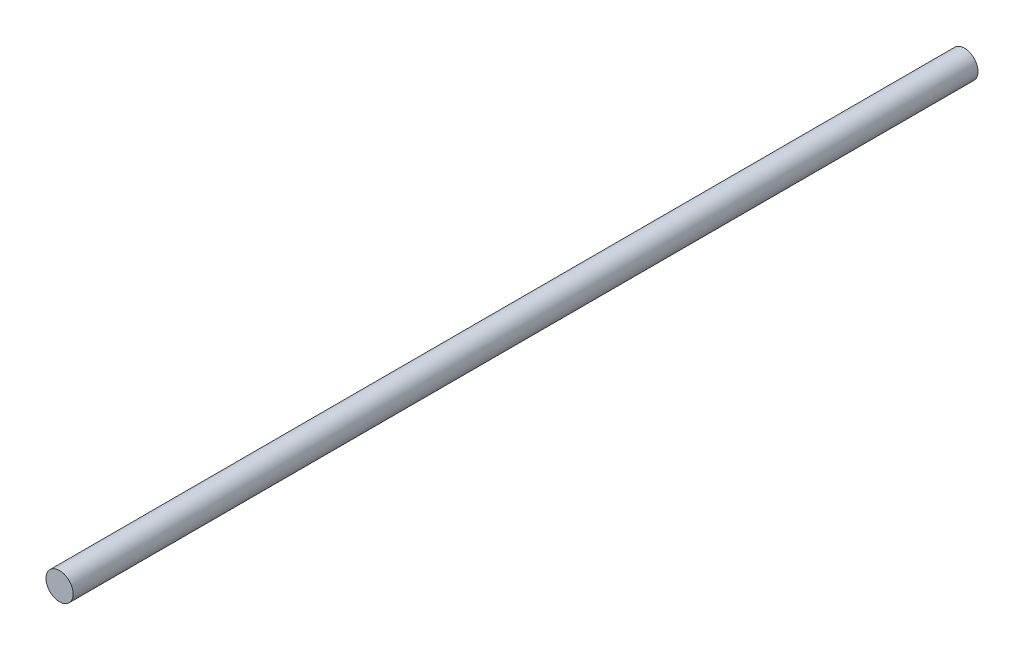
ISO-10303-21;
HEADER;
FILE_DESCRIPTION(('STEP AP214'),'2;1');
FILE_NAME('part.step','',(''),(''),'','','');
FILE_SCHEMA(('AUTOMOTIVE_DESIGN { 1 0 10303 214 1 1 1 1 }'));
ENDSEC;
DATA;
#1=APPLICATION_CONTEXT('core data for automotive mechanical design processes');
#2=APPLICATION_PROTOCOL_DEFINITION('international standard','automotive_design',2000,#1);
#3=PRODUCT_CONTEXT('',#1,'mechanical');
#4=PRODUCT('Part','Part','',(#3));
#5=PRODUCT_RELATED_PRODUCT_CATEGORY('part','',(#4));
#6=PRODUCT_DEFINITION_FORMATION('','',#4);
#7=PRODUCT_DEFINITION_CONTEXT('part definition',#1,'design');
#8=PRODUCT_DEFINITION('design','',#6,#7);
#9=PRODUCT_DEFINITION_SHAPE('','',#8);
#10=(LENGTH_UNIT() NAMED_UNIT(*) SI_UNIT(.MILLI.,.METRE.));
#11=(NAMED_UNIT(*) PLANE_ANGLE_UNIT() SI_UNIT($,.RADIAN.));
#12=(NAMED_UNIT(*) SI_UNIT($,.STERADIAN.) SOLID_ANGLE_UNIT());
#13=UNCERTAINTY_MEASURE_WITH_UNIT(LENGTH_MEASURE(1.E-05),#10,'distance_accuracy_value','');
#14=(GEOMETRIC_REPRESENTATION_CONTEXT(3) GLOBAL_UNCERTAINTY_ASSIGNED_CONTEXT((#13)) GLOBAL_UNIT_ASSIGNED_CONTEXT((#10,
#11,#12)) REPRESENTATION_CONTEXT('',''));
#15=CARTESIAN_POINT('',(0.,0.,0.));
#16=DIRECTION('',(0.,0.,1.));
#17=DIRECTION('',(1.,0.,0.));
#18=AXIS2_PLACEMENT_3D('',#15,#16,#17);
#19=CARTESIAN_POINT('',(0.,0.,0.));
#20=DIRECTION('',(0.,0.,-1.));
#21=DIRECTION('',(-1.,0.,0.));
#22=AXIS2_PLACEMENT_3D('',#19,#20,#21);
#23=CYLINDRICAL_SURFACE('',#22,0.75);
#24=CARTESIAN_POINT('',(0.,0.,0.));
#25=DIRECTION('',(0.,0.,1.));
#26=DIRECTION('',(1.,0.,0.));
#27=AXIS2_PLACEMENT_3D('',#24,#25,#26);
#28=CIRCLE('',#27,0.75);
#29=CARTESIAN_POINT('',(0.75,0.,0.));
#30=VERTEX_POINT('',#29);
#31=EDGE_CURVE('E10',#30,#30,#28,.T.);
#32=ORIENTED_EDGE('',*,*,#31,.F.);
#33=EDGE_LOOP('',(#32));
#34=FACE_BOUND('',#33,.T.);
#35=CARTESIAN_POINT('',(0.,0.,-50.));
#36=DIRECTION('',(0.,0.,1.));
#37=DIRECTION('',(1.,0.,0.));
#38=AXIS2_PLACEMENT_3D('',#35,#36,#37);
#39=CIRCLE('',#38,0.75);
#40=CARTESIAN_POINT('',(0.75,0.,-50.));
#41=VERTEX_POINT('',#40);
#42=EDGE_CURVE('E37',#41,#41,#39,.T.);
#43=ORIENTED_EDGE('',*,*,#42,.T.);
#44=EDGE_LOOP('',(#43));
#45=FACE_BOUND('',#44,.T.);
#46=ADVANCED_FACE('F34',(#34,#45),#23,.T.);
#47=CARTESIAN_POINT('',(0.,0.,0.));
#48=DIRECTION('',(0.,0.,1.));
#49=DIRECTION('',(1.,0.,0.));
#50=AXIS2_PLACEMENT_3D('',#47,#48,#49);
#51=PLANE('',#50);
#52=ORIENTED_EDGE('',*,*,#31,.T.);
#53=EDGE_LOOP('',(#52));
#54=FACE_BOUND('',#53,.T.);
#55=ADVANCED_FACE('F52',(#54),#51,.T.);
#56=CARTESIAN_POINT('',(0.,0.,-50.));
#57=DIRECTION('',(0.,0.,1.));
#58=DIRECTION('',(1.,0.,0.));
#59=AXIS2_PLACEMENT_3D('',#56,#57,#58);
#60=PLANE('',#59);
#61=ORIENTED_EDGE('',*,*,#42,.F.);
#62=EDGE_LOOP('',(#61));
#63=FACE_BOUND('',#62,.T.);
#64=ADVANCED_FACE('F50',(#63),#60,.F.);
#65=CLOSED_SHELL('',(#46,#55,#64));
#66=MANIFOLD_SOLID_BREP('B2',#65);
#67=ADVANCED_BREP_SHAPE_REPRESENTATION('',(#18,#66),#14);
#68=SHAPE_DEFINITION_REPRESENTATION(#9,#67);
ENDSEC;
END-ISO-10303-21;
